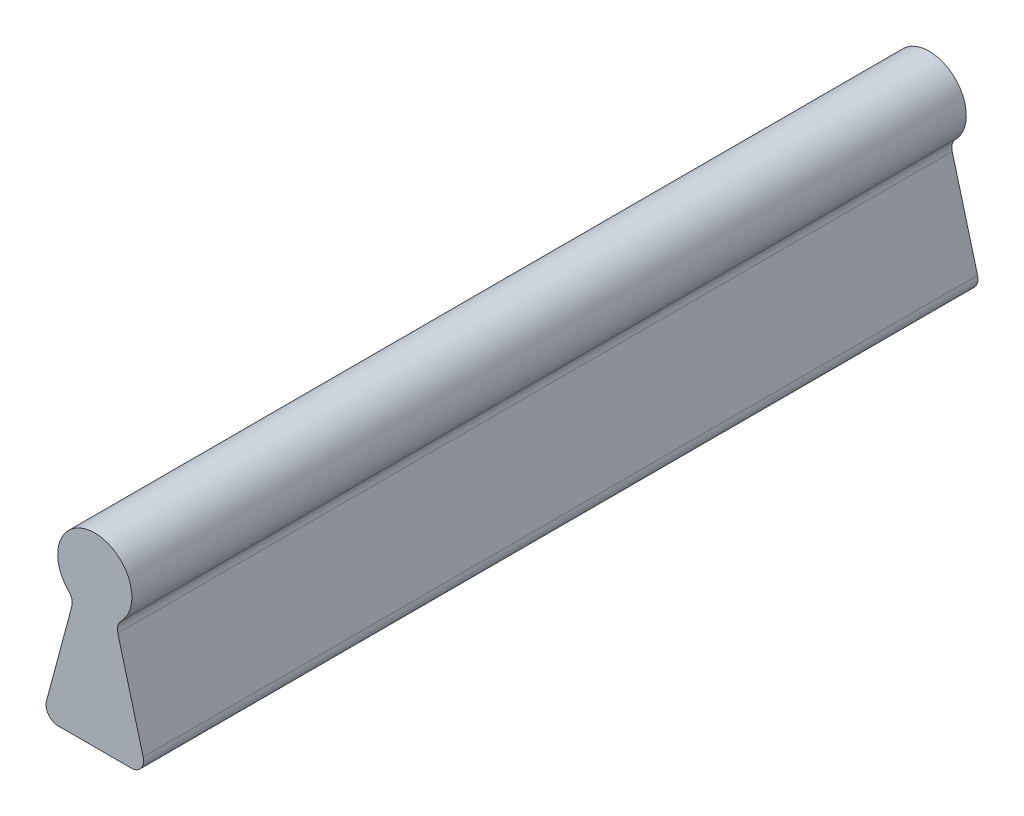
from build123d import *

# Parameters (mm, degrees)
BOSS_EXTRU_1_DEPTH = 67.5


with BuildPart() as part:
    # Esquisse1 → Boss.-Extru.1 (new body)
    with BuildSketch(Plane.XY):
        with BuildLine():
            Line((25.413366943, -5.741180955), (23.362501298, 1.91275383))
            ThreePointArc((23.362501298, 1.91275383), (23.362501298, 2.43039192), (23.621320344, 2.878679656))
            ThreePointArc((23.621320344, 2.878679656), (21.5, 8), (19.378679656, 2.878679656))
            ThreePointArc((19.378679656, 2.878679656), (19.637498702, 2.43039192), (19.637498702, 1.91275383))
            Line((19.637498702, 1.91275383), (17.586633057, -5.741180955))
            ThreePointArc((17.586633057, -5.741180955), (17.759205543, -6.608761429), (18.552558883, -7))
            Line((18.552558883, -7), (24.447441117, -7))
            ThreePointArc((24.447441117, -7), (25.240794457, -6.608761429), (25.413366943, -5.741180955))
        make_face()
    extrude(amount=BOSS_EXTRU_1_DEPTH)


solid = part.part
